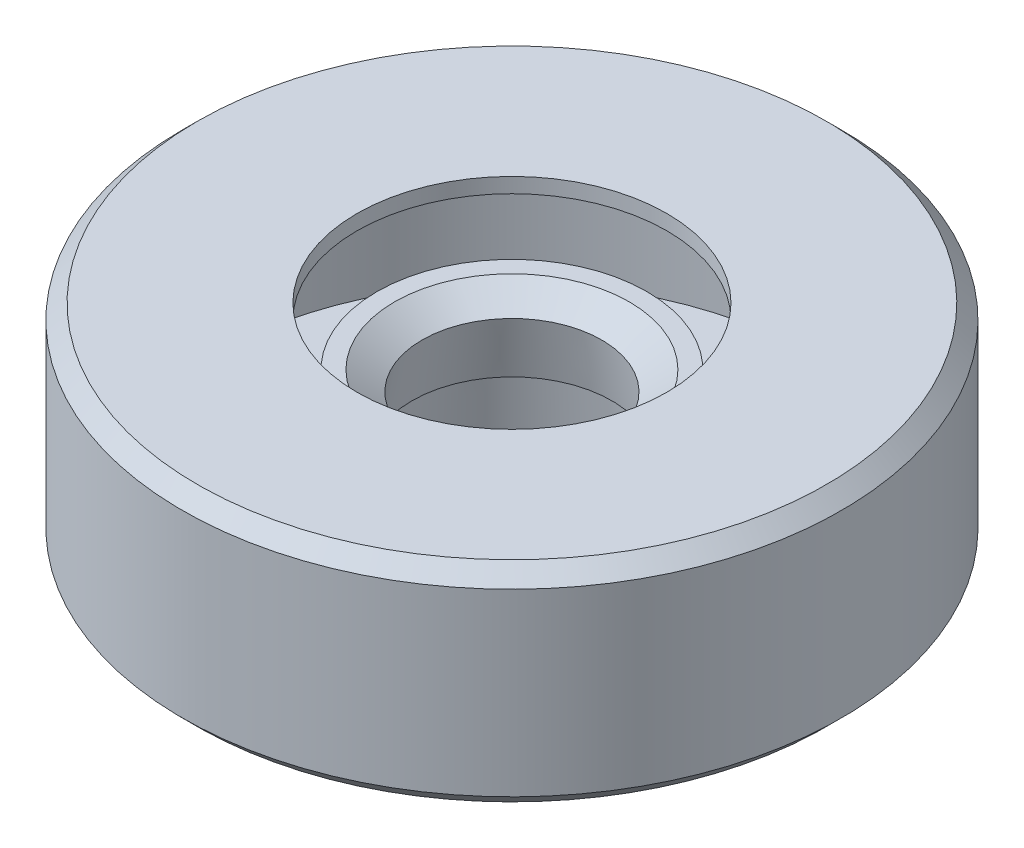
from build123d import *


with BuildPart() as part:
    # Sketch 1 → Revolve 1 (revolve)
    with BuildSketch(Plane.XY):
        with BuildLine():
            Line((-10, 0.5), (-5.524030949, 0.5))
            Line((-5.524030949, 0.5), (-5.170477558, 1.112372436))
            Line((-5.170477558, 1.112372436), (-4.463370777, 1.112372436))
            Line((-4.463370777, 1.112372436), (-4.30697363, 2.9))
            ThreePointArc((-4.30697363, 2.9), (-4.74222381, 3.244464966), (-4.50697363, 3.747213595))
            Line((-4.50697363, 3.747213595), (-4.50697363, 5.071428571))
            Line((-4.50697363, 5.071428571), (-3.918095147, 5.071428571))
            Line((-3.918095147, 5.071428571), (-3, 4.428571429))
            Line((-3, 4.428571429), (-3.340059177, 2.5))
            Line((-3.340059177, 2.5), (-3.840059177, 2.5))
            Line((-3.840059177, 2.5), (-4.058780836, 0))
            Line((-4.058780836, 0), (-10.5, 0))
            Line((-10.5, 0), (-11, 0.5))
            Line((-11, 0.5), (-11, 6.5))
            Line((-11, 6.5), (-10.5, 7))
            Line((-10.5, 7), (-5.170477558, 7))
            Line((-5.170477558, 7), (-5.170477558, 6.5))
            Line((-5.170477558, 6.5), (-10, 6.5))
            Line((-10, 6.5), (-10, 0.5))
        make_face()
    revolve(axis=Axis((0, 5.836193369, 0), (0, -1, 0)))


solid = part.part
